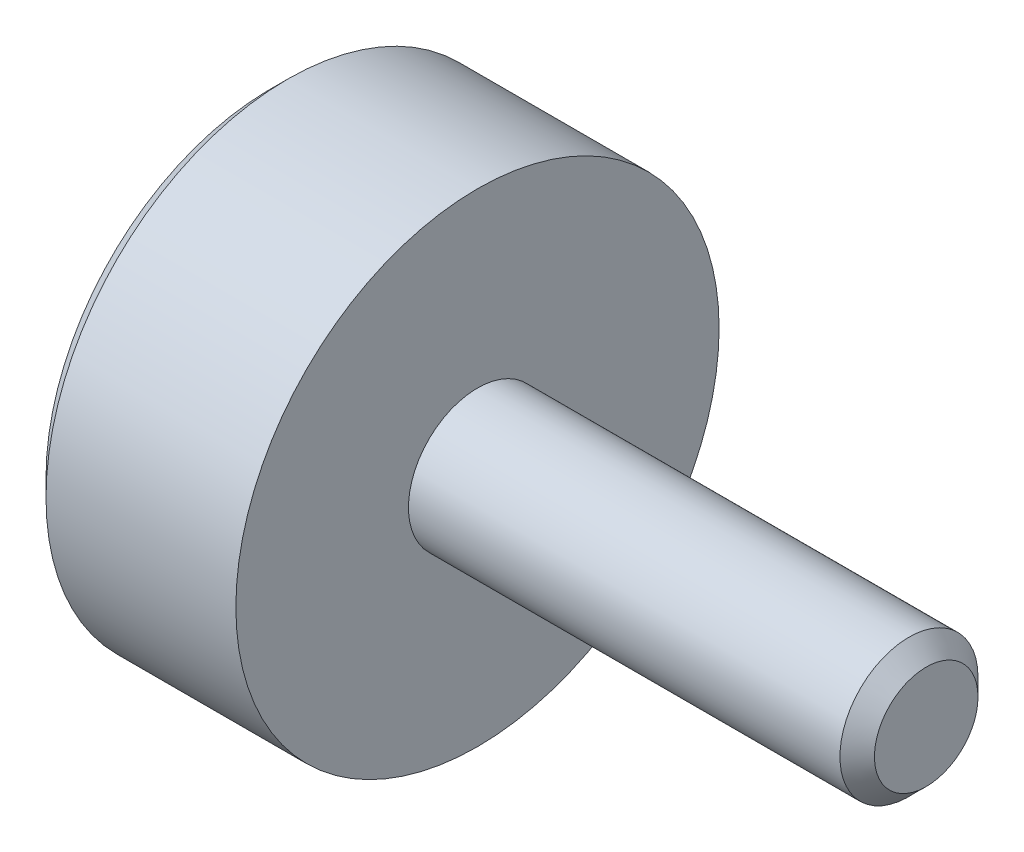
ISO-10303-21;
HEADER;
FILE_DESCRIPTION(('STEP AP214'),'2;1');
FILE_NAME('part.step','',(''),(''),'','','');
FILE_SCHEMA(('AUTOMOTIVE_DESIGN { 1 0 10303 214 1 1 1 1 }'));
ENDSEC;
DATA;
#1=APPLICATION_CONTEXT('core data for automotive mechanical design processes');
#2=APPLICATION_PROTOCOL_DEFINITION('international standard','automotive_design',2000,#1);
#3=PRODUCT_CONTEXT('',#1,'mechanical');
#4=PRODUCT('Part','Part','',(#3));
#5=PRODUCT_RELATED_PRODUCT_CATEGORY('part','',(#4));
#6=PRODUCT_DEFINITION_FORMATION('','',#4);
#7=PRODUCT_DEFINITION_CONTEXT('part definition',#1,'design');
#8=PRODUCT_DEFINITION('design','',#6,#7);
#9=PRODUCT_DEFINITION_SHAPE('','',#8);
#10=(LENGTH_UNIT() NAMED_UNIT(*) SI_UNIT(.MILLI.,.METRE.));
#11=(NAMED_UNIT(*) PLANE_ANGLE_UNIT() SI_UNIT($,.RADIAN.));
#12=(NAMED_UNIT(*) SI_UNIT($,.STERADIAN.) SOLID_ANGLE_UNIT());
#13=UNCERTAINTY_MEASURE_WITH_UNIT(LENGTH_MEASURE(1.E-05),#10,'distance_accuracy_value','');
#14=(GEOMETRIC_REPRESENTATION_CONTEXT(3) GLOBAL_UNCERTAINTY_ASSIGNED_CONTEXT((#13)) GLOBAL_UNIT_ASSIGNED_CONTEXT((#10,
#11,#12)) REPRESENTATION_CONTEXT('',''));
#15=CARTESIAN_POINT('',(0.,0.,0.));
#16=DIRECTION('',(0.,0.,1.));
#17=DIRECTION('',(1.,0.,0.));
#18=AXIS2_PLACEMENT_3D('',#15,#16,#17);
#19=CARTESIAN_POINT('',(22.2249999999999,6.35,0.));
#20=DIRECTION('',(1.,0.,0.));
#21=DIRECTION('',(0.,0.,-1.));
#22=AXIS2_PLACEMENT_3D('',#19,#20,#21);
#23=PLANE('',#22);
#24=CARTESIAN_POINT('',(22.2249999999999,0.,0.));
#25=DIRECTION('',(1.,0.,0.));
#26=DIRECTION('',(0.,0.,-1.));
#27=AXIS2_PLACEMENT_3D('',#24,#25,#26);
#28=CIRCLE('',#27,4.7625);
#29=CARTESIAN_POINT('',(22.2249999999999,0.,-4.7625));
#30=VERTEX_POINT('',#29);
#31=EDGE_CURVE('E143',#30,#30,#28,.T.);
#32=ORIENTED_EDGE('',*,*,#31,.T.);
#33=EDGE_LOOP('',(#32));
#34=FACE_BOUND('',#33,.T.);
#35=ADVANCED_FACE('F30',(#34),#23,.T.);
#36=CARTESIAN_POINT('',(-38.1,22.225,0.));
#37=DIRECTION('',(-1.,0.,0.));
#38=DIRECTION('',(0.,0.,1.));
#39=AXIS2_PLACEMENT_3D('',#36,#37,#38);
#40=PLANE('',#39);
#41=DIRECTION('',(0.,0.866025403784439,0.5));
#42=VECTOR('',#41,1.);
#43=CARTESIAN_POINT('',(-38.1,-12.7,7.33234841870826));
#44=LINE('',#43,#42);
#45=CARTESIAN_POINT('',(-38.1,-12.7,7.33234841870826));
#46=VERTEX_POINT('',#45);
#47=CARTESIAN_POINT('',(-38.1,0.,14.6646968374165));
#48=VERTEX_POINT('',#47);
#49=EDGE_CURVE('E45',#46,#48,#44,.T.);
#50=ORIENTED_EDGE('',*,*,#49,.F.);
#51=DIRECTION('',(0.,0.,1.));
#52=VECTOR('',#51,1.);
#53=CARTESIAN_POINT('',(-38.1,-12.7,-7.33234841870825));
#54=LINE('',#53,#52);
#55=CARTESIAN_POINT('',(-38.1,-12.7,-7.33234841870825));
#56=VERTEX_POINT('',#55);
#57=EDGE_CURVE('E128',#56,#46,#54,.T.);
#58=ORIENTED_EDGE('',*,*,#57,.F.);
#59=DIRECTION('',(0.,-0.866025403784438,0.5));
#60=VECTOR('',#59,1.);
#61=CARTESIAN_POINT('',(-38.1,0.,-14.6646968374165));
#62=LINE('',#61,#60);
#63=CARTESIAN_POINT('',(-38.1,0.,-14.6646968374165));
#64=VERTEX_POINT('',#63);
#65=EDGE_CURVE('E126',#64,#56,#62,.T.);
#66=ORIENTED_EDGE('',*,*,#65,.F.);
#67=DIRECTION('',(0.,-0.866025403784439,-0.5));
#68=VECTOR('',#67,1.);
#69=CARTESIAN_POINT('',(-38.1,12.7,-7.33234841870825));
#70=LINE('',#69,#68);
#71=CARTESIAN_POINT('',(-38.1,12.7,-7.33234841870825));
#72=VERTEX_POINT('',#71);
#73=EDGE_CURVE('E93',#72,#64,#70,.T.);
#74=ORIENTED_EDGE('',*,*,#73,.F.);
#75=DIRECTION('',(0.,0.,-1.));
#76=VECTOR('',#75,1.);
#77=CARTESIAN_POINT('',(-38.1,12.7,7.33234841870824));
#78=LINE('',#77,#76);
#79=CARTESIAN_POINT('',(-38.1,12.7,7.33234841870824));
#80=VERTEX_POINT('',#79);
#81=EDGE_CURVE('E122',#80,#72,#78,.T.);
#82=ORIENTED_EDGE('',*,*,#81,.F.);
#83=DIRECTION('',(0.,0.866025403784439,-0.5));
#84=VECTOR('',#83,1.);
#85=CARTESIAN_POINT('',(-38.1,0.,14.6646968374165));
#86=LINE('',#85,#84);
#87=EDGE_CURVE('E119',#48,#80,#86,.T.);
#88=ORIENTED_EDGE('',*,*,#87,.F.);
#89=EDGE_LOOP('',(#50,#58,#66,#74,#82,#88));
#90=FACE_BOUND('',#89,.T.);
#91=CARTESIAN_POINT('',(-38.1,0.,0.));
#92=DIRECTION('',(-1.,0.,0.));
#93=DIRECTION('',(0.,0.,1.));
#94=AXIS2_PLACEMENT_3D('',#91,#92,#93);
#95=CIRCLE('',#94,20.6375);
#96=CARTESIAN_POINT('',(-38.1,0.,20.6375));
#97=VERTEX_POINT('',#96);
#98=EDGE_CURVE('E11',#97,#97,#95,.T.);
#99=ORIENTED_EDGE('',*,*,#98,.T.);
#100=EDGE_LOOP('',(#99));
#101=FACE_BOUND('',#100,.T.);
#102=ADVANCED_FACE('F168',(#90,#101),#40,.T.);
#103=CARTESIAN_POINT('',(0.,0.,0.));
#104=DIRECTION('',(1.,0.,0.));
#105=DIRECTION('',(0.,0.,-1.));
#106=AXIS2_PLACEMENT_3D('',#103,#104,#105);
#107=CYLINDRICAL_SURFACE('',#106,22.225);
#108=CARTESIAN_POINT('',(-36.5125,0.,0.));
#109=DIRECTION('',(-1.,0.,0.));
#110=DIRECTION('',(0.,0.,1.));
#111=AXIS2_PLACEMENT_3D('',#108,#109,#110);
#112=CIRCLE('',#111,22.225);
#113=CARTESIAN_POINT('',(-36.5125,0.,22.225));
#114=VERTEX_POINT('',#113);
#115=EDGE_CURVE('E38',#114,#114,#112,.F.);
#116=ORIENTED_EDGE('',*,*,#115,.T.);
#117=EDGE_LOOP('',(#116));
#118=FACE_BOUND('',#117,.T.);
#119=CARTESIAN_POINT('',(-19.05,0.,0.));
#120=DIRECTION('',(1.,0.,0.));
#121=DIRECTION('',(0.,0.,-1.));
#122=AXIS2_PLACEMENT_3D('',#119,#120,#121);
#123=CIRCLE('',#122,22.225);
#124=CARTESIAN_POINT('',(-19.05,0.,-22.225));
#125=VERTEX_POINT('',#124);
#126=EDGE_CURVE('E140',#125,#125,#123,.T.);
#127=ORIENTED_EDGE('',*,*,#126,.F.);
#128=EDGE_LOOP('',(#127));
#129=FACE_BOUND('',#128,.T.);
#130=ADVANCED_FACE('F151',(#118,#129),#107,.T.);
#131=CARTESIAN_POINT('',(-19.05,6.34999999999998,0.));
#132=DIRECTION('',(1.,0.,0.));
#133=DIRECTION('',(0.,0.,-1.));
#134=AXIS2_PLACEMENT_3D('',#131,#132,#133);
#135=PLANE('',#134);
#136=ORIENTED_EDGE('',*,*,#126,.T.);
#137=EDGE_LOOP('',(#136));
#138=FACE_BOUND('',#137,.T.);
#139=CARTESIAN_POINT('',(-19.05,0.,0.));
#140=DIRECTION('',(1.,0.,0.));
#141=DIRECTION('',(0.,0.,-1.));
#142=AXIS2_PLACEMENT_3D('',#139,#140,#141);
#143=CIRCLE('',#142,6.34999999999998);
#144=CARTESIAN_POINT('',(-19.05,0.,-6.34999999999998));
#145=VERTEX_POINT('',#144);
#146=EDGE_CURVE('E132',#145,#145,#143,.T.);
#147=ORIENTED_EDGE('',*,*,#146,.F.);
#148=EDGE_LOOP('',(#147));
#149=FACE_BOUND('',#148,.T.);
#150=ADVANCED_FACE('F179',(#138,#149),#135,.T.);
#151=CARTESIAN_POINT('',(0.,0.,0.));
#152=DIRECTION('',(1.,0.,0.));
#153=DIRECTION('',(0.,0.,-1.));
#154=AXIS2_PLACEMENT_3D('',#151,#152,#153);
#155=CYLINDRICAL_SURFACE('',#154,6.34999999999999);
#156=CARTESIAN_POINT('',(20.6374999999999,0.,0.));
#157=DIRECTION('',(1.,0.,0.));
#158=DIRECTION('',(0.,0.,-1.));
#159=AXIS2_PLACEMENT_3D('',#156,#157,#158);
#160=CIRCLE('',#159,6.34999999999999);
#161=CARTESIAN_POINT('',(20.6374999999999,0.,-6.34999999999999));
#162=VERTEX_POINT('',#161);
#163=EDGE_CURVE('E146',#162,#162,#160,.F.);
#164=ORIENTED_EDGE('',*,*,#163,.T.);
#165=EDGE_LOOP('',(#164));
#166=FACE_BOUND('',#165,.T.);
#167=ORIENTED_EDGE('',*,*,#146,.T.);
#168=EDGE_LOOP('',(#167));
#169=FACE_BOUND('',#168,.T.);
#170=ADVANCED_FACE('F164',(#166,#169),#155,.T.);
#171=CARTESIAN_POINT('',(22.2249999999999,0.,0.));
#172=DIRECTION('',(-1.,0.,0.));
#173=DIRECTION('',(0.,0.,1.));
#174=AXIS2_PLACEMENT_3D('',#171,#172,#173);
#175=CONICAL_SURFACE('',#174,4.7625,0.785398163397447);
#176=ORIENTED_EDGE('',*,*,#163,.F.);
#177=EDGE_LOOP('',(#176));
#178=FACE_BOUND('',#177,.T.);
#179=ORIENTED_EDGE('',*,*,#31,.F.);
#180=EDGE_LOOP('',(#179));
#181=FACE_BOUND('',#180,.T.);
#182=ADVANCED_FACE('F156',(#178,#181),#175,.T.);
#183=CARTESIAN_POINT('',(-36.5125,0.,0.));
#184=DIRECTION('',(1.,0.,0.));
#185=DIRECTION('',(0.,0.,-1.));
#186=AXIS2_PLACEMENT_3D('',#183,#184,#185);
#187=CONICAL_SURFACE('',#186,22.225,0.78539816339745);
#188=ORIENTED_EDGE('',*,*,#98,.F.);
#189=EDGE_LOOP('',(#188));
#190=FACE_BOUND('',#189,.T.);
#191=ORIENTED_EDGE('',*,*,#115,.F.);
#192=EDGE_LOOP('',(#191));
#193=FACE_BOUND('',#192,.T.);
#194=ADVANCED_FACE('F32',(#190,#193),#187,.T.);
#195=CARTESIAN_POINT('',(-25.4,-12.7,7.33234841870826));
#196=DIRECTION('',(0.,-0.5,0.866025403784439));
#197=DIRECTION('',(0.,-0.866025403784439,-0.5));
#198=AXIS2_PLACEMENT_3D('',#195,#196,#197);
#199=PLANE('',#198);
#200=ORIENTED_EDGE('',*,*,#49,.T.);
#201=DIRECTION('',(-1.,0.,0.));
#202=VECTOR('',#201,1.);
#203=CARTESIAN_POINT('',(-25.4,0.,14.6646968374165));
#204=LINE('',#203,#202);
#205=CARTESIAN_POINT('',(-25.4,0.,14.6646968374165));
#206=VERTEX_POINT('',#205);
#207=EDGE_CURVE('E75',#206,#48,#204,.T.);
#208=ORIENTED_EDGE('',*,*,#207,.F.);
#209=DIRECTION('',(0.,0.866025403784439,0.5));
#210=VECTOR('',#209,1.);
#211=CARTESIAN_POINT('',(-25.4,-12.7,7.33234841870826));
#212=LINE('',#211,#210);
#213=CARTESIAN_POINT('',(-25.4,-12.7,7.33234841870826));
#214=VERTEX_POINT('',#213);
#215=EDGE_CURVE('E130',#214,#206,#212,.T.);
#216=ORIENTED_EDGE('',*,*,#215,.F.);
#217=DIRECTION('',(-1.,0.,0.));
#218=VECTOR('',#217,1.);
#219=CARTESIAN_POINT('',(-25.4,-12.7,7.33234841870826));
#220=LINE('',#219,#218);
#221=EDGE_CURVE('E53',#214,#46,#220,.T.);
#222=ORIENTED_EDGE('',*,*,#221,.T.);
#223=EDGE_LOOP('',(#200,#208,#216,#222));
#224=FACE_BOUND('',#223,.T.);
#225=ADVANCED_FACE('F155',(#224),#199,.F.);
#226=CARTESIAN_POINT('',(-25.4,-12.7,-7.33234841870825));
#227=DIRECTION('',(0.,-1.,0.));
#228=DIRECTION('',(0.,0.,-1.));
#229=AXIS2_PLACEMENT_3D('',#226,#227,#228);
#230=PLANE('',#229);
#231=ORIENTED_EDGE('',*,*,#57,.T.);
#232=ORIENTED_EDGE('',*,*,#221,.F.);
#233=DIRECTION('',(0.,0.,1.));
#234=VECTOR('',#233,1.);
#235=CARTESIAN_POINT('',(-25.4,-12.7,-7.33234841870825));
#236=LINE('',#235,#234);
#237=CARTESIAN_POINT('',(-25.4,-12.7,-7.33234841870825));
#238=VERTEX_POINT('',#237);
#239=EDGE_CURVE('E105',#238,#214,#236,.T.);
#240=ORIENTED_EDGE('',*,*,#239,.F.);
#241=DIRECTION('',(-1.,0.,0.));
#242=VECTOR('',#241,1.);
#243=CARTESIAN_POINT('',(-25.4,-12.7,-7.33234841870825));
#244=LINE('',#243,#242);
#245=EDGE_CURVE('E97',#238,#56,#244,.T.);
#246=ORIENTED_EDGE('',*,*,#245,.T.);
#247=EDGE_LOOP('',(#231,#232,#240,#246));
#248=FACE_BOUND('',#247,.T.);
#249=ADVANCED_FACE('F162',(#248),#230,.F.);
#250=CARTESIAN_POINT('',(-25.4,0.,-14.6646968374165));
#251=DIRECTION('',(0.,-0.5,-0.866025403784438));
#252=DIRECTION('',(0.,0.866025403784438,-0.5));
#253=AXIS2_PLACEMENT_3D('',#250,#251,#252);
#254=PLANE('',#253);
#255=ORIENTED_EDGE('',*,*,#65,.T.);
#256=ORIENTED_EDGE('',*,*,#245,.F.);
#257=DIRECTION('',(0.,-0.866025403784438,0.5));
#258=VECTOR('',#257,1.);
#259=CARTESIAN_POINT('',(-25.4,0.,-14.6646968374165));
#260=LINE('',#259,#258);
#261=CARTESIAN_POINT('',(-25.4,0.,-14.6646968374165));
#262=VERTEX_POINT('',#261);
#263=EDGE_CURVE('E101',#262,#238,#260,.T.);
#264=ORIENTED_EDGE('',*,*,#263,.F.);
#265=DIRECTION('',(-1.,0.,0.));
#266=VECTOR('',#265,1.);
#267=CARTESIAN_POINT('',(-25.4,0.,-14.6646968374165));
#268=LINE('',#267,#266);
#269=EDGE_CURVE('E86',#262,#64,#268,.T.);
#270=ORIENTED_EDGE('',*,*,#269,.T.);
#271=EDGE_LOOP('',(#255,#256,#264,#270));
#272=FACE_BOUND('',#271,.T.);
#273=ADVANCED_FACE('F102',(#272),#254,.F.);
#274=CARTESIAN_POINT('',(-25.4,12.7,-7.33234841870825));
#275=DIRECTION('',(0.,0.5,-0.866025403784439));
#276=DIRECTION('',(0.,0.866025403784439,0.5));
#277=AXIS2_PLACEMENT_3D('',#274,#275,#276);
#278=PLANE('',#277);
#279=ORIENTED_EDGE('',*,*,#73,.T.);
#280=ORIENTED_EDGE('',*,*,#269,.F.);
#281=DIRECTION('',(0.,-0.866025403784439,-0.5));
#282=VECTOR('',#281,1.);
#283=CARTESIAN_POINT('',(-25.4,12.7,-7.33234841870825));
#284=LINE('',#283,#282);
#285=CARTESIAN_POINT('',(-25.4,12.7,-7.33234841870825));
#286=VERTEX_POINT('',#285);
#287=EDGE_CURVE('E90',#286,#262,#284,.T.);
#288=ORIENTED_EDGE('',*,*,#287,.F.);
#289=DIRECTION('',(-1.,0.,0.));
#290=VECTOR('',#289,1.);
#291=CARTESIAN_POINT('',(-25.4,12.7,-7.33234841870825));
#292=LINE('',#291,#290);
#293=EDGE_CURVE('E98',#286,#72,#292,.T.);
#294=ORIENTED_EDGE('',*,*,#293,.T.);
#295=EDGE_LOOP('',(#279,#280,#288,#294));
#296=FACE_BOUND('',#295,.T.);
#297=ADVANCED_FACE('F88',(#296),#278,.F.);
#298=CARTESIAN_POINT('',(-25.4,12.7,7.33234841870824));
#299=DIRECTION('',(0.,1.,0.));
#300=DIRECTION('',(0.,0.,1.));
#301=AXIS2_PLACEMENT_3D('',#298,#299,#300);
#302=PLANE('',#301);
#303=ORIENTED_EDGE('',*,*,#81,.T.);
#304=ORIENTED_EDGE('',*,*,#293,.F.);
#305=DIRECTION('',(0.,0.,-1.));
#306=VECTOR('',#305,1.);
#307=CARTESIAN_POINT('',(-25.4,12.7,7.33234841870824));
#308=LINE('',#307,#306);
#309=CARTESIAN_POINT('',(-25.4,12.7,7.33234841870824));
#310=VERTEX_POINT('',#309);
#311=EDGE_CURVE('E111',#310,#286,#308,.T.);
#312=ORIENTED_EDGE('',*,*,#311,.F.);
#313=DIRECTION('',(-1.,0.,0.));
#314=VECTOR('',#313,1.);
#315=CARTESIAN_POINT('',(-25.4,12.7,7.33234841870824));
#316=LINE('',#315,#314);
#317=EDGE_CURVE('E135',#310,#80,#316,.T.);
#318=ORIENTED_EDGE('',*,*,#317,.T.);
#319=EDGE_LOOP('',(#303,#304,#312,#318));
#320=FACE_BOUND('',#319,.T.);
#321=ADVANCED_FACE('F189',(#320),#302,.F.);
#322=CARTESIAN_POINT('',(-25.4,0.,14.6646968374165));
#323=DIRECTION('',(0.,0.5,0.866025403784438));
#324=DIRECTION('',(0.,-0.866025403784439,0.5));
#325=AXIS2_PLACEMENT_3D('',#322,#323,#324);
#326=PLANE('',#325);
#327=ORIENTED_EDGE('',*,*,#87,.T.);
#328=ORIENTED_EDGE('',*,*,#317,.F.);
#329=DIRECTION('',(0.,0.866025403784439,-0.5));
#330=VECTOR('',#329,1.);
#331=CARTESIAN_POINT('',(-25.4,0.,14.6646968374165));
#332=LINE('',#331,#330);
#333=EDGE_CURVE('E113',#206,#310,#332,.T.);
#334=ORIENTED_EDGE('',*,*,#333,.F.);
#335=ORIENTED_EDGE('',*,*,#207,.T.);
#336=EDGE_LOOP('',(#327,#328,#334,#335));
#337=FACE_BOUND('',#336,.T.);
#338=ADVANCED_FACE('F186',(#337),#326,.F.);
#339=CARTESIAN_POINT('',(-25.4,-25.4,0.));
#340=DIRECTION('',(1.,0.,0.));
#341=DIRECTION('',(0.,0.,-1.));
#342=AXIS2_PLACEMENT_3D('',#339,#340,#341);
#343=PLANE('',#342);
#344=ORIENTED_EDGE('',*,*,#215,.T.);
#345=ORIENTED_EDGE('',*,*,#333,.T.);
#346=ORIENTED_EDGE('',*,*,#311,.T.);
#347=ORIENTED_EDGE('',*,*,#287,.T.);
#348=ORIENTED_EDGE('',*,*,#263,.T.);
#349=ORIENTED_EDGE('',*,*,#239,.T.);
#350=EDGE_LOOP('',(#344,#345,#346,#347,#348,#349));
#351=FACE_BOUND('',#350,.T.);
#352=ADVANCED_FACE('F108',(#351),#343,.F.);
#353=CLOSED_SHELL('',(#35,#102,#130,#150,#170,#182,#194,#225,#249,#273,#297,#321,#338,#352));
#354=MANIFOLD_SOLID_BREP('B2',#353);
#355=ADVANCED_BREP_SHAPE_REPRESENTATION('',(#18,#354),#14);
#356=SHAPE_DEFINITION_REPRESENTATION(#9,#355);
ENDSEC;
END-ISO-10303-21;
